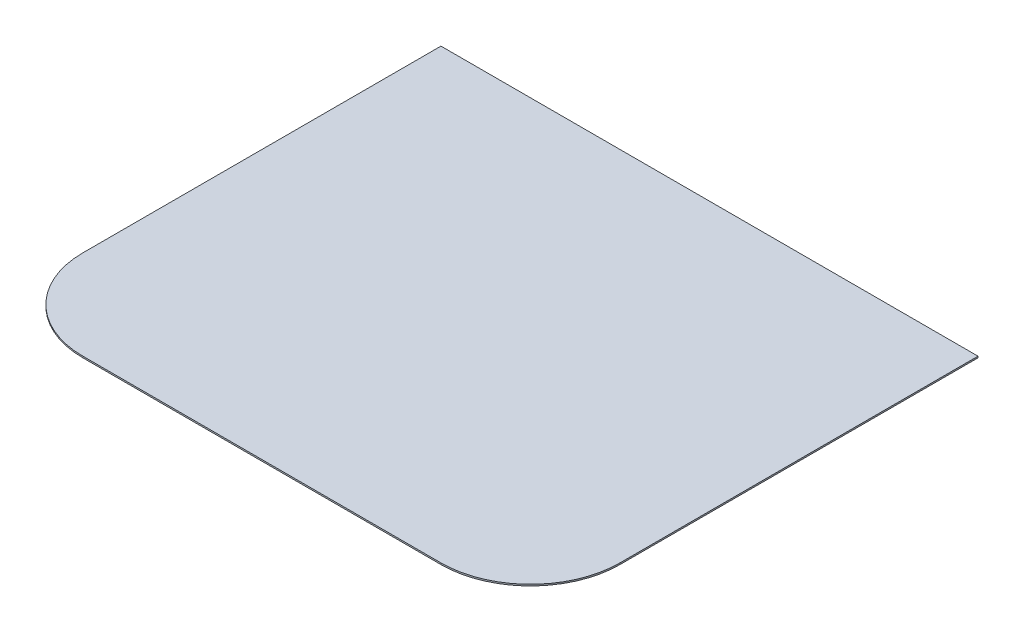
ISO-10303-21;
HEADER;
FILE_DESCRIPTION(('STEP AP214'),'2;1');
FILE_NAME('part.step','',(''),(''),'','','');
FILE_SCHEMA(('AUTOMOTIVE_DESIGN { 1 0 10303 214 1 1 1 1 }'));
ENDSEC;
DATA;
#1=APPLICATION_CONTEXT('core data for automotive mechanical design processes');
#2=APPLICATION_PROTOCOL_DEFINITION('international standard','automotive_design',2000,#1);
#3=PRODUCT_CONTEXT('',#1,'mechanical');
#4=PRODUCT('Part','Part','',(#3));
#5=PRODUCT_RELATED_PRODUCT_CATEGORY('part','',(#4));
#6=PRODUCT_DEFINITION_FORMATION('','',#4);
#7=PRODUCT_DEFINITION_CONTEXT('part definition',#1,'design');
#8=PRODUCT_DEFINITION('design','',#6,#7);
#9=PRODUCT_DEFINITION_SHAPE('','',#8);
#10=(LENGTH_UNIT() NAMED_UNIT(*) SI_UNIT(.MILLI.,.METRE.));
#11=(NAMED_UNIT(*) PLANE_ANGLE_UNIT() SI_UNIT($,.RADIAN.));
#12=(NAMED_UNIT(*) SI_UNIT($,.STERADIAN.) SOLID_ANGLE_UNIT());
#13=UNCERTAINTY_MEASURE_WITH_UNIT(LENGTH_MEASURE(1.E-05),#10,'distance_accuracy_value','');
#14=(GEOMETRIC_REPRESENTATION_CONTEXT(3) GLOBAL_UNCERTAINTY_ASSIGNED_CONTEXT((#13)) GLOBAL_UNIT_ASSIGNED_CONTEXT((#10,
#11,#12)) REPRESENTATION_CONTEXT('',''));
#15=CARTESIAN_POINT('',(0.,0.,0.));
#16=DIRECTION('',(0.,0.,1.));
#17=DIRECTION('',(1.,0.,0.));
#18=AXIS2_PLACEMENT_3D('',#15,#16,#17);
#19=CARTESIAN_POINT('',(0.,2.54,0.));
#20=DIRECTION('',(0.,0.,-1.));
#21=DIRECTION('',(-1.,0.,0.));
#22=AXIS2_PLACEMENT_3D('',#19,#20,#21);
#23=PLANE('',#22);
#24=DIRECTION('',(0.,1.,0.));
#25=VECTOR('',#24,1.);
#26=CARTESIAN_POINT('',(762.,0.,0.));
#27=LINE('',#26,#25);
#28=CARTESIAN_POINT('',(762.,0.,0.));
#29=VERTEX_POINT('',#28);
#30=CARTESIAN_POINT('',(762.,2.54,0.));
#31=VERTEX_POINT('',#30);
#32=EDGE_CURVE('E48',#29,#31,#27,.T.);
#33=ORIENTED_EDGE('',*,*,#32,.T.);
#34=DIRECTION('',(1.,0.,0.));
#35=VECTOR('',#34,1.);
#36=CARTESIAN_POINT('',(0.,2.54,0.));
#37=LINE('',#36,#35);
#38=CARTESIAN_POINT('',(152.4,2.54,0.));
#39=VERTEX_POINT('',#38);
#40=EDGE_CURVE('E122',#39,#31,#37,.T.);
#41=ORIENTED_EDGE('',*,*,#40,.F.);
#42=DIRECTION('',(0.,1.,0.));
#43=VECTOR('',#42,1.);
#44=CARTESIAN_POINT('',(152.4,0.,0.));
#45=LINE('',#44,#43);
#46=CARTESIAN_POINT('',(152.4,0.,0.));
#47=VERTEX_POINT('',#46);
#48=EDGE_CURVE('E125',#47,#39,#45,.T.);
#49=ORIENTED_EDGE('',*,*,#48,.F.);
#50=DIRECTION('',(1.,0.,0.));
#51=VECTOR('',#50,1.);
#52=CARTESIAN_POINT('',(0.,0.,0.));
#53=LINE('',#52,#51);
#54=EDGE_CURVE('E105',#47,#29,#53,.T.);
#55=ORIENTED_EDGE('',*,*,#54,.T.);
#56=EDGE_LOOP('',(#33,#41,#49,#55));
#57=FACE_BOUND('',#56,.T.);
#58=ADVANCED_FACE('F33',(#57),#23,.F.);
#59=CARTESIAN_POINT('',(0.,2.54,0.));
#60=DIRECTION('',(1.,0.,0.));
#61=DIRECTION('',(0.,0.,-1.));
#62=AXIS2_PLACEMENT_3D('',#59,#60,#61);
#63=PLANE('',#62);
#64=DIRECTION('',(0.,1.,0.));
#65=VECTOR('',#64,1.);
#66=CARTESIAN_POINT('',(0.,0.,-152.4));
#67=LINE('',#66,#65);
#68=CARTESIAN_POINT('',(0.,0.,-152.4));
#69=VERTEX_POINT('',#68);
#70=CARTESIAN_POINT('',(0.,2.54,-152.4));
#71=VERTEX_POINT('',#70);
#72=EDGE_CURVE('E56',#69,#71,#67,.T.);
#73=ORIENTED_EDGE('',*,*,#72,.T.);
#74=DIRECTION('',(0.,0.,1.));
#75=VECTOR('',#74,1.);
#76=CARTESIAN_POINT('',(0.,2.54,0.));
#77=LINE('',#76,#75);
#78=CARTESIAN_POINT('',(0.,2.54,-762.));
#79=VERTEX_POINT('',#78);
#80=EDGE_CURVE('E107',#79,#71,#77,.T.);
#81=ORIENTED_EDGE('',*,*,#80,.F.);
#82=DIRECTION('',(0.,-1.,0.));
#83=VECTOR('',#82,1.);
#84=CARTESIAN_POINT('',(0.,2.54,-762.));
#85=LINE('',#84,#83);
#86=CARTESIAN_POINT('',(0.,0.,-762.));
#87=VERTEX_POINT('',#86);
#88=EDGE_CURVE('E41',#79,#87,#85,.T.);
#89=ORIENTED_EDGE('',*,*,#88,.T.);
#90=DIRECTION('',(0.,0.,1.));
#91=VECTOR('',#90,1.);
#92=CARTESIAN_POINT('',(0.,0.,0.));
#93=LINE('',#92,#91);
#94=EDGE_CURVE('E109',#87,#69,#93,.T.);
#95=ORIENTED_EDGE('',*,*,#94,.T.);
#96=EDGE_LOOP('',(#73,#81,#89,#95));
#97=FACE_BOUND('',#96,.T.);
#98=ADVANCED_FACE('F35',(#97),#63,.F.);
#99=CARTESIAN_POINT('',(914.4,2.54,0.));
#100=DIRECTION('',(-1.,0.,0.));
#101=DIRECTION('',(0.,0.,1.));
#102=AXIS2_PLACEMENT_3D('',#99,#100,#101);
#103=PLANE('',#102);
#104=DIRECTION('',(0.,0.,-1.));
#105=VECTOR('',#104,1.);
#106=CARTESIAN_POINT('',(914.4,2.54,0.));
#107=LINE('',#106,#105);
#108=CARTESIAN_POINT('',(914.4,2.54,-152.4));
#109=VERTEX_POINT('',#108);
#110=CARTESIAN_POINT('',(914.4,2.54,-762.));
#111=VERTEX_POINT('',#110);
#112=EDGE_CURVE('E99',#109,#111,#107,.T.);
#113=ORIENTED_EDGE('',*,*,#112,.F.);
#114=DIRECTION('',(0.,1.,0.));
#115=VECTOR('',#114,1.);
#116=CARTESIAN_POINT('',(914.4,0.,-152.4));
#117=LINE('',#116,#115);
#118=CARTESIAN_POINT('',(914.4,0.,-152.4));
#119=VERTEX_POINT('',#118);
#120=EDGE_CURVE('E86',#119,#109,#117,.T.);
#121=ORIENTED_EDGE('',*,*,#120,.F.);
#122=DIRECTION('',(0.,0.,-1.));
#123=VECTOR('',#122,1.);
#124=CARTESIAN_POINT('',(914.4,0.,0.));
#125=LINE('',#124,#123);
#126=CARTESIAN_POINT('',(914.4,0.,-762.));
#127=VERTEX_POINT('',#126);
#128=EDGE_CURVE('E98',#119,#127,#125,.T.);
#129=ORIENTED_EDGE('',*,*,#128,.T.);
#130=DIRECTION('',(0.,-1.,0.));
#131=VECTOR('',#130,1.);
#132=CARTESIAN_POINT('',(914.4,2.54,-762.));
#133=LINE('',#132,#131);
#134=EDGE_CURVE('E11',#111,#127,#133,.T.);
#135=ORIENTED_EDGE('',*,*,#134,.F.);
#136=EDGE_LOOP('',(#113,#121,#129,#135));
#137=FACE_BOUND('',#136,.T.);
#138=ADVANCED_FACE('F96',(#137),#103,.F.);
#139=CARTESIAN_POINT('',(0.,2.54,-762.));
#140=DIRECTION('',(0.,0.,1.));
#141=DIRECTION('',(1.,0.,0.));
#142=AXIS2_PLACEMENT_3D('',#139,#140,#141);
#143=PLANE('',#142);
#144=DIRECTION('',(-1.,0.,0.));
#145=VECTOR('',#144,1.);
#146=CARTESIAN_POINT('',(0.,0.,-762.));
#147=LINE('',#146,#145);
#148=EDGE_CURVE('E104',#127,#87,#147,.T.);
#149=ORIENTED_EDGE('',*,*,#148,.T.);
#150=ORIENTED_EDGE('',*,*,#88,.F.);
#151=DIRECTION('',(-1.,0.,0.));
#152=VECTOR('',#151,1.);
#153=CARTESIAN_POINT('',(0.,2.54,-762.));
#154=LINE('',#153,#152);
#155=EDGE_CURVE('E113',#111,#79,#154,.T.);
#156=ORIENTED_EDGE('',*,*,#155,.F.);
#157=ORIENTED_EDGE('',*,*,#134,.T.);
#158=EDGE_LOOP('',(#149,#150,#156,#157));
#159=FACE_BOUND('',#158,.T.);
#160=ADVANCED_FACE('F158',(#159),#143,.F.);
#161=CARTESIAN_POINT('',(0.,2.54,0.));
#162=DIRECTION('',(0.,-1.,0.));
#163=DIRECTION('',(0.,0.,-1.));
#164=AXIS2_PLACEMENT_3D('',#161,#162,#163);
#165=PLANE('',#164);
#166=ORIENTED_EDGE('',*,*,#40,.T.);
#167=CARTESIAN_POINT('',(762.,2.54,-152.4));
#168=DIRECTION('',(0.,-1.,0.));
#169=DIRECTION('',(0.,0.,-1.));
#170=AXIS2_PLACEMENT_3D('',#167,#168,#169);
#171=CIRCLE('',#170,152.4);
#172=EDGE_CURVE('E92',#109,#31,#171,.T.);
#173=ORIENTED_EDGE('',*,*,#172,.F.);
#174=ORIENTED_EDGE('',*,*,#112,.T.);
#175=ORIENTED_EDGE('',*,*,#155,.T.);
#176=ORIENTED_EDGE('',*,*,#80,.T.);
#177=CARTESIAN_POINT('',(152.4,2.54,-152.4));
#178=DIRECTION('',(0.,-1.,0.));
#179=DIRECTION('',(0.,0.,1.));
#180=AXIS2_PLACEMENT_3D('',#177,#178,#179);
#181=CIRCLE('',#180,152.4);
#182=EDGE_CURVE('E132',#39,#71,#181,.T.);
#183=ORIENTED_EDGE('',*,*,#182,.F.);
#184=EDGE_LOOP('',(#166,#173,#174,#175,#176,#183));
#185=FACE_BOUND('',#184,.T.);
#186=ADVANCED_FACE('F137',(#185),#165,.F.);
#187=CARTESIAN_POINT('',(0.,0.,0.));
#188=DIRECTION('',(0.,-1.,0.));
#189=DIRECTION('',(0.,0.,-1.));
#190=AXIS2_PLACEMENT_3D('',#187,#188,#189);
#191=PLANE('',#190);
#192=CARTESIAN_POINT('',(762.,0.,-152.4));
#193=DIRECTION('',(0.,-1.,0.));
#194=DIRECTION('',(0.,0.,-1.));
#195=AXIS2_PLACEMENT_3D('',#192,#193,#194);
#196=CIRCLE('',#195,152.4);
#197=EDGE_CURVE('E83',#119,#29,#196,.T.);
#198=ORIENTED_EDGE('',*,*,#197,.T.);
#199=ORIENTED_EDGE('',*,*,#54,.F.);
#200=CARTESIAN_POINT('',(152.4,0.,-152.4));
#201=DIRECTION('',(0.,-1.,0.));
#202=DIRECTION('',(0.,0.,1.));
#203=AXIS2_PLACEMENT_3D('',#200,#201,#202);
#204=CIRCLE('',#203,152.4);
#205=EDGE_CURVE('E129',#47,#69,#204,.T.);
#206=ORIENTED_EDGE('',*,*,#205,.T.);
#207=ORIENTED_EDGE('',*,*,#94,.F.);
#208=ORIENTED_EDGE('',*,*,#148,.F.);
#209=ORIENTED_EDGE('',*,*,#128,.F.);
#210=EDGE_LOOP('',(#198,#199,#206,#207,#208,#209));
#211=FACE_BOUND('',#210,.T.);
#212=ADVANCED_FACE('F102',(#211),#191,.T.);
#213=CARTESIAN_POINT('',(152.4,0.,-152.4));
#214=DIRECTION('',(0.,1.,0.));
#215=DIRECTION('',(0.,0.,1.));
#216=AXIS2_PLACEMENT_3D('',#213,#214,#215);
#217=CYLINDRICAL_SURFACE('',#216,152.4);
#218=ORIENTED_EDGE('',*,*,#182,.T.);
#219=ORIENTED_EDGE('',*,*,#72,.F.);
#220=ORIENTED_EDGE('',*,*,#205,.F.);
#221=ORIENTED_EDGE('',*,*,#48,.T.);
#222=EDGE_LOOP('',(#218,#219,#220,#221));
#223=FACE_BOUND('',#222,.T.);
#224=ADVANCED_FACE('F141',(#223),#217,.T.);
#225=CARTESIAN_POINT('',(762.,0.,-152.4));
#226=DIRECTION('',(0.,1.,0.));
#227=DIRECTION('',(0.,0.,1.));
#228=AXIS2_PLACEMENT_3D('',#225,#226,#227);
#229=CYLINDRICAL_SURFACE('',#228,152.4);
#230=ORIENTED_EDGE('',*,*,#172,.T.);
#231=ORIENTED_EDGE('',*,*,#32,.F.);
#232=ORIENTED_EDGE('',*,*,#197,.F.);
#233=ORIENTED_EDGE('',*,*,#120,.T.);
#234=EDGE_LOOP('',(#230,#231,#232,#233));
#235=FACE_BOUND('',#234,.T.);
#236=ADVANCED_FACE('F85',(#235),#229,.T.);
#237=CLOSED_SHELL('',(#58,#98,#138,#160,#186,#212,#224,#236));
#238=MANIFOLD_SOLID_BREP('B2',#237);
#239=ADVANCED_BREP_SHAPE_REPRESENTATION('',(#18,#238),#14);
#240=SHAPE_DEFINITION_REPRESENTATION(#9,#239);
ENDSEC;
END-ISO-10303-21;
